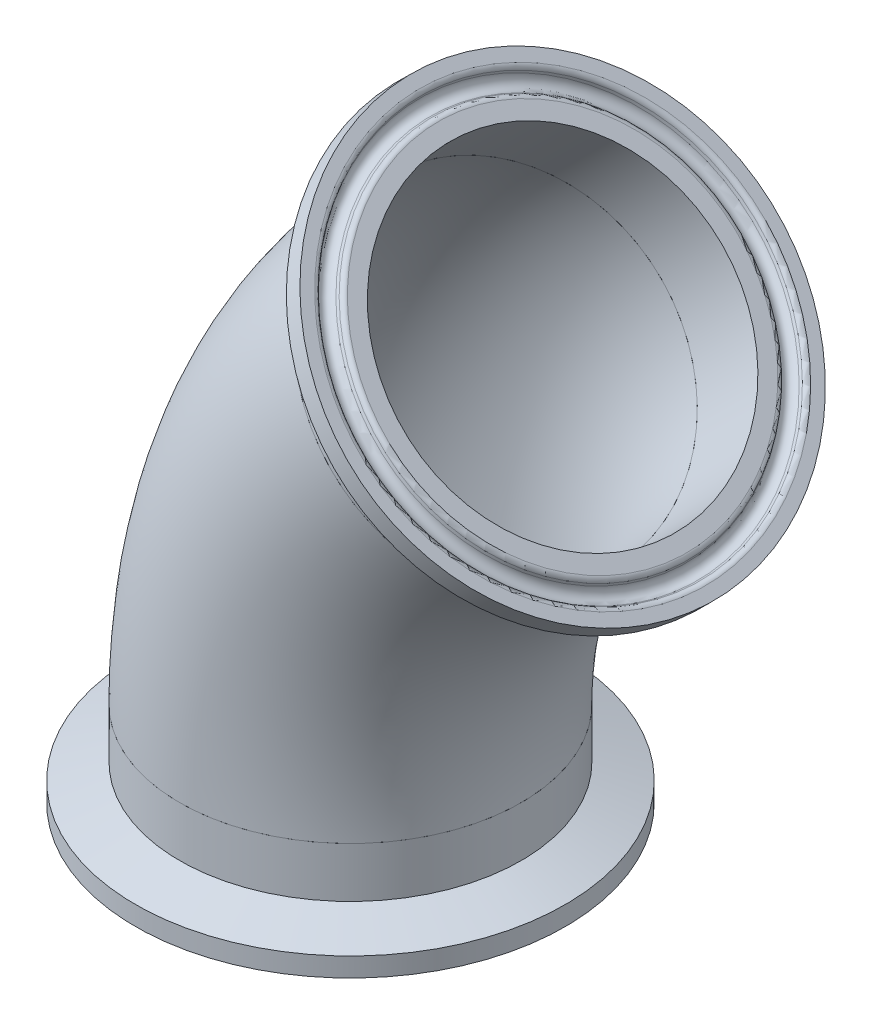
ISO-10303-21;
HEADER;
FILE_DESCRIPTION(('STEP AP214'),'2;1');
FILE_NAME('part.step','',(''),(''),'','','');
FILE_SCHEMA(('AUTOMOTIVE_DESIGN { 1 0 10303 214 1 1 1 1 }'));
ENDSEC;
DATA;
#1=APPLICATION_CONTEXT('core data for automotive mechanical design processes');
#2=APPLICATION_PROTOCOL_DEFINITION('international standard','automotive_design',2000,#1);
#3=PRODUCT_CONTEXT('',#1,'mechanical');
#4=PRODUCT('Part','Part','',(#3));
#5=PRODUCT_RELATED_PRODUCT_CATEGORY('part','',(#4));
#6=PRODUCT_DEFINITION_FORMATION('','',#4);
#7=PRODUCT_DEFINITION_CONTEXT('part definition',#1,'design');
#8=PRODUCT_DEFINITION('design','',#6,#7);
#9=PRODUCT_DEFINITION_SHAPE('','',#8);
#10=(LENGTH_UNIT() NAMED_UNIT(*) SI_UNIT(.MILLI.,.METRE.));
#11=(NAMED_UNIT(*) PLANE_ANGLE_UNIT() SI_UNIT($,.RADIAN.));
#12=(NAMED_UNIT(*) SI_UNIT($,.STERADIAN.) SOLID_ANGLE_UNIT());
#13=UNCERTAINTY_MEASURE_WITH_UNIT(LENGTH_MEASURE(1.E-05),#10,'distance_accuracy_value','');
#14=(GEOMETRIC_REPRESENTATION_CONTEXT(3) GLOBAL_UNCERTAINTY_ASSIGNED_CONTEXT((#13)) GLOBAL_UNIT_ASSIGNED_CONTEXT((#10,
#11,#12)) REPRESENTATION_CONTEXT('',''));
#15=CARTESIAN_POINT('',(0.,0.,0.));
#16=DIRECTION('',(0.,0.,1.));
#17=DIRECTION('',(1.,0.,0.));
#18=AXIS2_PLACEMENT_3D('',#15,#16,#17);
#19=CARTESIAN_POINT('',(49.8815076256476,67.8224797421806,41.6470972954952));
#20=DIRECTION('',(-0.710059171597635,-0.704142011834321,0.));
#21=DIRECTION('',(-0.703933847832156,0.709849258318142,-0.0243139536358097));
#22=AXIS2_PLACEMENT_3D('',#19,#20,#21);
#23=PLANE('',#22);
#24=CARTESIAN_POINT('',(49.8815076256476,67.8224797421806,41.6470972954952));
#25=DIRECTION('',(0.710059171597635,0.704142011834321,0.));
#26=DIRECTION('',(0.703933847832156,-0.709849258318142,0.0243139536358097));
#27=AXIS2_PLACEMENT_3D('',#24,#25,#26);
#28=CIRCLE('',#27,30.1591722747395);
#29=CARTESIAN_POINT('',(71.1115698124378,46.4140136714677,42.3803860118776));
#30=VERTEX_POINT('',#29);
#31=EDGE_CURVE('P0_E9',#30,#30,#28,.T.);
#32=ORIENTED_EDGE('',*,*,#31,.F.);
#33=EDGE_LOOP('',(#32));
#34=FACE_BOUND('',#33,.T.);
#35=CARTESIAN_POINT('',(49.8815076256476,67.8224797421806,41.6470972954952));
#36=DIRECTION('',(0.710059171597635,0.704142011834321,0.));
#37=DIRECTION('',(0.703933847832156,-0.709849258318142,0.0243139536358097));
#38=AXIS2_PLACEMENT_3D('',#35,#36,#37);
#39=CIRCLE('',#38,31.9532);
#40=CARTESIAN_POINT('',(72.374446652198,45.1405244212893,42.4240059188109));
#41=VERTEX_POINT('',#40);
#42=EDGE_CURVE('P0_E54',#41,#41,#39,.T.);
#43=ORIENTED_EDGE('',*,*,#42,.T.);
#44=EDGE_LOOP('',(#43));
#45=FACE_BOUND('',#44,.T.);
#46=ADVANCED_FACE('P0_F14',(#34,#45),#23,.F.);
#47=CARTESIAN_POINT('',(49.3224070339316,67.2680383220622,41.6470972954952));
#48=DIRECTION('',(0.710059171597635,0.704142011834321,0.));
#49=DIRECTION('',(0.703933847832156,-0.709849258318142,0.0243139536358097));
#50=AXIS2_PLACEMENT_3D('',#47,#48,#49);
#51=TOROIDAL_SURFACE('',#50,30.1591722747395,0.7874);
#52=CARTESIAN_POINT('',(49.5408650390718,67.4846758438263,41.6470972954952));
#53=DIRECTION('',(0.710059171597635,0.704142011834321,0.));
#54=DIRECTION('',(0.703933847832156,-0.709849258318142,0.0243139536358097));
#55=AXIS2_PLACEMENT_3D('',#52,#53,#54);
#56=CIRCLE('',#55,29.4343667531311);
#57=CARTESIAN_POINT('',(70.2607120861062,46.590712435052,42.3627631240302));
#58=VERTEX_POINT('',#57);
#59=EDGE_CURVE('P0_E20',#58,#58,#56,.T.);
#60=ORIENTED_EDGE('',*,*,#59,.F.);
#61=EDGE_LOOP('',(#60));
#62=FACE_BOUND('',#61,.T.);
#63=ORIENTED_EDGE('',*,*,#31,.T.);
#64=EDGE_LOOP('',(#63));
#65=FACE_BOUND('',#64,.T.);
#66=ADVANCED_FACE('P0_F96',(#62,#65),#51,.T.);
#67=CARTESIAN_POINT('',(49.2617290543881,67.2078659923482,41.6470972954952));
#68=DIRECTION('',(0.710059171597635,0.704142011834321,0.));
#69=DIRECTION('',(0.703933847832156,-0.709849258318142,0.0243139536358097));
#70=AXIS2_PLACEMENT_3D('',#67,#68,#69);
#71=CONICAL_SURFACE('',#70,29.2674986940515,0.401425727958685);
#72=ORIENTED_EDGE('',*,*,#59,.T.);
#73=EDGE_LOOP('',(#72));
#74=FACE_BOUND('',#73,.T.);
#75=CARTESIAN_POINT('',(49.2617290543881,67.2078659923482,41.6470972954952));
#76=DIRECTION('',(0.710059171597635,0.704142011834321,0.));
#77=DIRECTION('',(0.703933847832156,-0.709849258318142,0.0243139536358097));
#78=AXIS2_PLACEMENT_3D('',#75,#76,#77);
#79=CIRCLE('',#78,29.2674986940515);
#80=CARTESIAN_POINT('',(69.8641120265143,46.4323537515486,42.3587059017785));
#81=VERTEX_POINT('',#80);
#82=EDGE_CURVE('P0_E24',#81,#81,#79,.T.);
#83=ORIENTED_EDGE('',*,*,#82,.F.);
#84=EDGE_LOOP('',(#83));
#85=FACE_BOUND('',#84,.T.);
#86=ADVANCED_FACE('P0_F101',(#74,#85),#71,.F.);
#87=CARTESIAN_POINT('',(49.5929395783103,67.5363164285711,41.6470972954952));
#88=DIRECTION('',(0.710059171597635,0.704142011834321,0.));
#89=DIRECTION('',(0.703933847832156,-0.709849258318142,0.0243139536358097));
#90=AXIS2_PLACEMENT_3D('',#87,#88,#89);
#91=TOROIDAL_SURFACE('',#90,28.1686,1.1938);
#92=CARTESIAN_POINT('',(49.261729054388,67.2078659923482,41.6470972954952));
#93=DIRECTION('',(0.710059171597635,0.704142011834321,0.));
#94=DIRECTION('',(0.703933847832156,-0.709849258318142,0.0243139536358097));
#95=AXIS2_PLACEMENT_3D('',#92,#93,#94);
#96=CIRCLE('',#95,27.0697013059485);
#97=CARTESIAN_POINT('',(68.3170080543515,47.992458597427,42.3052687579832));
#98=VERTEX_POINT('',#97);
#99=EDGE_CURVE('P0_E28',#98,#98,#96,.T.);
#100=ORIENTED_EDGE('',*,*,#99,.F.);
#101=EDGE_LOOP('',(#100));
#102=FACE_BOUND('',#101,.T.);
#103=ORIENTED_EDGE('',*,*,#82,.T.);
#104=EDGE_LOOP('',(#103));
#105=FACE_BOUND('',#104,.T.);
#106=ADVANCED_FACE('P0_F106',(#102,#105),#91,.F.);
#107=CARTESIAN_POINT('',(49.261729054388,67.2078659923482,41.6470972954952));
#108=DIRECTION('',(-0.710059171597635,-0.704142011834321,0.));
#109=DIRECTION('',(-0.703933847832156,0.709849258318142,-0.0243139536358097));
#110=AXIS2_PLACEMENT_3D('',#107,#108,#109);
#111=CONICAL_SURFACE('',#110,27.0697013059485,0.401425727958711);
#112=CARTESIAN_POINT('',(49.5408650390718,67.4846758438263,41.6470972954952));
#113=DIRECTION('',(0.710059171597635,0.704142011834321,0.));
#114=DIRECTION('',(0.703933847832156,-0.709849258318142,0.0243139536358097));
#115=AXIS2_PLACEMENT_3D('',#112,#113,#114);
#116=CIRCLE('',#115,26.9028332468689);
#117=CARTESIAN_POINT('',(68.4786799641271,48.3877196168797,42.3012115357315));
#118=VERTEX_POINT('',#117);
#119=EDGE_CURVE('P0_E33',#118,#118,#116,.T.);
#120=ORIENTED_EDGE('',*,*,#119,.F.);
#121=EDGE_LOOP('',(#120));
#122=FACE_BOUND('',#121,.T.);
#123=ORIENTED_EDGE('',*,*,#99,.T.);
#124=EDGE_LOOP('',(#123));
#125=FACE_BOUND('',#124,.T.);
#126=ADVANCED_FACE('P0_F111',(#122,#125),#111,.T.);
#127=CARTESIAN_POINT('',(49.3224070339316,67.2680383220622,41.6470972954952));
#128=DIRECTION('',(0.710059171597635,0.704142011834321,0.));
#129=DIRECTION('',(0.703933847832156,-0.709849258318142,0.0243139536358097));
#130=AXIS2_PLACEMENT_3D('',#127,#128,#129);
#131=TOROIDAL_SURFACE('',#130,26.1780277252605,0.787399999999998);
#132=ORIENTED_EDGE('',*,*,#119,.T.);
#133=EDGE_LOOP('',(#132));
#134=FACE_BOUND('',#133,.T.);
#135=CARTESIAN_POINT('',(49.8815076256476,67.8224797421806,41.6470972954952));
#136=DIRECTION('',(0.710059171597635,0.704142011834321,0.));
#137=DIRECTION('',(0.703933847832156,-0.709849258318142,0.0243139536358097));
#138=AXIS2_PLACEMENT_3D('',#135,#136,#137);
#139=CIRCLE('',#138,26.1780277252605);
#140=CARTESIAN_POINT('',(68.3091074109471,49.2400261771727,42.2835886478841));
#141=VERTEX_POINT('',#140);
#142=EDGE_CURVE('P0_E36',#141,#141,#139,.T.);
#143=ORIENTED_EDGE('',*,*,#142,.F.);
#144=EDGE_LOOP('',(#143));
#145=FACE_BOUND('',#144,.T.);
#146=ADVANCED_FACE('P0_F92',(#134,#145),#131,.T.);
#147=CARTESIAN_POINT('',(49.8815076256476,67.8224797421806,41.6470972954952));
#148=DIRECTION('',(-0.710059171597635,-0.704142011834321,0.));
#149=DIRECTION('',(-0.703933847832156,0.709849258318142,-0.0243139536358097));
#150=AXIS2_PLACEMENT_3D('',#147,#148,#149);
#151=PLANE('',#150);
#152=CARTESIAN_POINT('',(49.8815076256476,67.8224797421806,41.6470972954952));
#153=DIRECTION('',(0.710059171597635,0.704142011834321,0.));
#154=DIRECTION('',(0.703933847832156,-0.709849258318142,0.0243139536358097));
#155=AXIS2_PLACEMENT_3D('',#152,#153,#154);
#156=CIRCLE('',#155,23.749);
#157=CARTESIAN_POINT('',(66.5992325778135,50.964269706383,42.224529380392));
#158=VERTEX_POINT('',#157);
#159=EDGE_CURVE('P0_E39',#158,#158,#156,.T.);
#160=ORIENTED_EDGE('',*,*,#159,.F.);
#161=EDGE_LOOP('',(#160));
#162=FACE_BOUND('',#161,.T.);
#163=ORIENTED_EDGE('',*,*,#142,.T.);
#164=EDGE_LOOP('',(#163));
#165=FACE_BOUND('',#164,.T.);
#166=ADVANCED_FACE('P0_F85',(#162,#165),#151,.F.);
#167=CARTESIAN_POINT('',(49.8815076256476,67.8224797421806,41.6470972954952));
#168=DIRECTION('',(0.710059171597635,0.704142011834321,0.));
#169=DIRECTION('',(0.703933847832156,-0.709849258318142,0.0243139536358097));
#170=AXIS2_PLACEMENT_3D('',#167,#168,#169);
#171=CYLINDRICAL_SURFACE('',#170,23.749);
#172=ORIENTED_EDGE('',*,*,#159,.T.);
#173=EDGE_LOOP('',(#172));
#174=FACE_BOUND('',#173,.T.);
#175=CARTESIAN_POINT('',(40.8637561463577,58.8798761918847,41.6470972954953));
#176=DIRECTION('',(0.710059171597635,0.704142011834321,0.));
#177=DIRECTION('',(0.703933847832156,-0.709849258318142,0.0243139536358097));
#178=AXIS2_PLACEMENT_3D('',#175,#176,#177);
#179=CIRCLE('',#178,23.749);
#180=CARTESIAN_POINT('',(57.5814810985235,42.0216661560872,42.2245293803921));
#181=VERTEX_POINT('',#180);
#182=EDGE_CURVE('P0_E42',#181,#181,#179,.T.);
#183=ORIENTED_EDGE('',*,*,#182,.F.);
#184=EDGE_LOOP('',(#183));
#185=FACE_BOUND('',#184,.T.);
#186=ADVANCED_FACE('P0_F80',(#174,#185),#171,.F.);
#187=CARTESIAN_POINT('',(40.8637561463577,58.8798761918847,41.6470972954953));
#188=DIRECTION('',(0.710059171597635,0.704142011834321,0.));
#189=DIRECTION('',(0.703933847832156,-0.709849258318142,0.0243139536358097));
#190=AXIS2_PLACEMENT_3D('',#187,#188,#189);
#191=PLANE('',#190);
#192=CARTESIAN_POINT('',(40.8637561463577,58.8798761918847,41.6470972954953));
#193=DIRECTION('',(0.710059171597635,0.704142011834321,0.));
#194=DIRECTION('',(0.703933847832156,-0.709849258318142,0.0243139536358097));
#195=AXIS2_PLACEMENT_3D('',#192,#193,#194);
#196=CIRCLE('',#195,25.4);
#197=CARTESIAN_POINT('',(58.7436758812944,40.8497050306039,42.2646717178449));
#198=VERTEX_POINT('',#197);
#199=EDGE_CURVE('P0_E45',#198,#198,#196,.T.);
#200=ORIENTED_EDGE('',*,*,#199,.F.);
#201=EDGE_LOOP('',(#200));
#202=FACE_BOUND('',#201,.T.);
#203=ORIENTED_EDGE('',*,*,#182,.T.);
#204=EDGE_LOOP('',(#203));
#205=FACE_BOUND('',#204,.T.);
#206=ADVANCED_FACE('P0_F74',(#202,#205),#191,.F.);
#207=CARTESIAN_POINT('',(49.8815076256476,67.8224797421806,41.6470972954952));
#208=DIRECTION('',(0.710059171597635,0.704142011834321,0.));
#209=DIRECTION('',(0.703933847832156,-0.709849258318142,0.0243139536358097));
#210=AXIS2_PLACEMENT_3D('',#207,#208,#209);
#211=CYLINDRICAL_SURFACE('',#210,25.4);
#212=CARTESIAN_POINT('',(46.1679196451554,64.1398383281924,41.6470972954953));
#213=DIRECTION('',(0.710059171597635,0.704142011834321,0.));
#214=DIRECTION('',(0.703933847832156,-0.709849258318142,0.0243139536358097));
#215=AXIS2_PLACEMENT_3D('',#212,#213,#214);
#216=CIRCLE('',#215,25.4);
#217=CARTESIAN_POINT('',(64.0478393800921,46.1096671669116,42.2646717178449));
#218=VERTEX_POINT('',#217);
#219=EDGE_CURVE('P0_E48',#218,#218,#216,.T.);
#220=ORIENTED_EDGE('',*,*,#219,.F.);
#221=EDGE_LOOP('',(#220));
#222=FACE_BOUND('',#221,.T.);
#223=ORIENTED_EDGE('',*,*,#199,.T.);
#224=EDGE_LOOP('',(#223));
#225=FACE_BOUND('',#224,.T.);
#226=ADVANCED_FACE('P0_F68',(#222,#225),#211,.T.);
#227=CARTESIAN_POINT('',(46.1679196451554,64.1398383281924,41.6470972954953));
#228=DIRECTION('',(0.710059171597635,0.704142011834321,0.));
#229=DIRECTION('',(0.703933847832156,-0.709849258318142,0.0243139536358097));
#230=AXIS2_PLACEMENT_3D('',#227,#228,#229);
#231=CONICAL_SURFACE('',#230,25.4,1.22173047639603);
#232=CARTESIAN_POINT('',(47.8615312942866,65.8193365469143,41.6470972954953));
#233=DIRECTION('',(0.710059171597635,0.704142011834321,0.));
#234=DIRECTION('',(0.703933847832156,-0.709849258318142,0.0243139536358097));
#235=AXIS2_PLACEMENT_3D('',#232,#233,#234);
#236=CIRCLE('',#235,31.9532);
#237=CARTESIAN_POINT('',(70.3544703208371,43.137381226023,42.4240059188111));
#238=VERTEX_POINT('',#237);
#239=EDGE_CURVE('P0_E51',#238,#238,#236,.T.);
#240=ORIENTED_EDGE('',*,*,#239,.F.);
#241=EDGE_LOOP('',(#240));
#242=FACE_BOUND('',#241,.T.);
#243=ORIENTED_EDGE('',*,*,#219,.T.);
#244=EDGE_LOOP('',(#243));
#245=FACE_BOUND('',#244,.T.);
#246=ADVANCED_FACE('P0_F62',(#242,#245),#231,.T.);
#247=CARTESIAN_POINT('',(49.8815076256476,67.8224797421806,41.6470972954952));
#248=DIRECTION('',(0.710059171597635,0.704142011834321,0.));
#249=DIRECTION('',(0.703933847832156,-0.709849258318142,0.0243139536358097));
#250=AXIS2_PLACEMENT_3D('',#247,#248,#249);
#251=CYLINDRICAL_SURFACE('',#250,31.9532);
#252=ORIENTED_EDGE('',*,*,#42,.F.);
#253=EDGE_LOOP('',(#252));
#254=FACE_BOUND('',#253,.T.);
#255=ORIENTED_EDGE('',*,*,#239,.T.);
#256=EDGE_LOOP('',(#255));
#257=FACE_BOUND('',#256,.T.);
#258=ADVANCED_FACE('P0_F59',(#254,#257),#251,.T.);
#259=CLOSED_SHELL('',(#46,#66,#86,#106,#126,#146,#166,#186,#206,#226,#246,#258));
#260=MANIFOLD_SOLID_BREP('P0_B1',#259);
#261=CARTESIAN_POINT('',(18.3193774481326,-7.9266326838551,41.6470972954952));
#262=DIRECTION('',(0.,1.,0.));
#263=DIRECTION('',(0.,0.,1.));
#264=AXIS2_PLACEMENT_3D('',#261,#262,#263);
#265=PLANE('',#264);
#266=CARTESIAN_POINT('',(18.3193774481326,-7.9266326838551,41.6470972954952));
#267=DIRECTION('',(0.,-1.,0.));
#268=DIRECTION('',(0.,0.,-1.));
#269=AXIS2_PLACEMENT_3D('',#266,#267,#268);
#270=CIRCLE('',#269,30.1591722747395);
#271=CARTESIAN_POINT('',(18.3193774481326,-7.92663268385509,11.4879250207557));
#272=VERTEX_POINT('',#271);
#273=EDGE_CURVE('P1_E10',#272,#272,#270,.T.);
#274=ORIENTED_EDGE('',*,*,#273,.F.);
#275=EDGE_LOOP('',(#274));
#276=FACE_BOUND('',#275,.T.);
#277=CARTESIAN_POINT('',(18.3193774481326,-7.9266326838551,41.6470972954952));
#278=DIRECTION('',(0.,-1.,0.));
#279=DIRECTION('',(0.,0.,-1.));
#280=AXIS2_PLACEMENT_3D('',#277,#278,#279);
#281=CIRCLE('',#280,31.9532);
#282=CARTESIAN_POINT('',(18.3193774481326,-7.92663268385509,9.69389729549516));
#283=VERTEX_POINT('',#282);
#284=EDGE_CURVE('P1_E55',#283,#283,#281,.T.);
#285=ORIENTED_EDGE('',*,*,#284,.T.);
#286=EDGE_LOOP('',(#285));
#287=FACE_BOUND('',#286,.T.);
#288=ADVANCED_FACE('P1_F15',(#276,#287),#265,.F.);
#289=CARTESIAN_POINT('',(18.3193774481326,-7.13923268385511,41.6470972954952));
#290=DIRECTION('',(0.,-1.,0.));
#291=DIRECTION('',(0.,0.,-1.));
#292=AXIS2_PLACEMENT_3D('',#289,#290,#291);
#293=TOROIDAL_SURFACE('',#292,30.1591722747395,0.7874);
#294=CARTESIAN_POINT('',(18.3193774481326,-7.44689437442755,41.6470972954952));
#295=DIRECTION('',(0.,-1.,0.));
#296=DIRECTION('',(0.,0.,-1.));
#297=AXIS2_PLACEMENT_3D('',#294,#295,#296);
#298=CIRCLE('',#297,29.4343667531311);
#299=CARTESIAN_POINT('',(18.3193774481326,-7.44689437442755,12.2127305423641));
#300=VERTEX_POINT('',#299);
#301=EDGE_CURVE('P1_E21',#300,#300,#298,.T.);
#302=ORIENTED_EDGE('',*,*,#301,.F.);
#303=EDGE_LOOP('',(#302));
#304=FACE_BOUND('',#303,.T.);
#305=ORIENTED_EDGE('',*,*,#273,.T.);
#306=EDGE_LOOP('',(#305));
#307=FACE_BOUND('',#306,.T.);
#308=ADVANCED_FACE('P1_F97',(#304,#307),#293,.T.);
#309=CARTESIAN_POINT('',(18.3193774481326,-7.05377786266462,41.6470972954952));
#310=DIRECTION('',(0.,-1.,0.));
#311=DIRECTION('',(0.,0.,-1.));
#312=AXIS2_PLACEMENT_3D('',#309,#310,#311);
#313=CONICAL_SURFACE('',#312,29.2674986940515,0.401425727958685);
#314=ORIENTED_EDGE('',*,*,#301,.T.);
#315=EDGE_LOOP('',(#314));
#316=FACE_BOUND('',#315,.T.);
#317=CARTESIAN_POINT('',(18.3193774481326,-7.05377786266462,41.6470972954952));
#318=DIRECTION('',(0.,-1.,0.));
#319=DIRECTION('',(0.,0.,-1.));
#320=AXIS2_PLACEMENT_3D('',#317,#318,#319);
#321=CIRCLE('',#320,29.2674986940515);
#322=CARTESIAN_POINT('',(18.3193774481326,-7.05377786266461,12.3795986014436));
#323=VERTEX_POINT('',#322);
#324=EDGE_CURVE('P1_E25',#323,#323,#321,.T.);
#325=ORIENTED_EDGE('',*,*,#324,.F.);
#326=EDGE_LOOP('',(#325));
#327=FACE_BOUND('',#326,.T.);
#328=ADVANCED_FACE('P1_F102',(#316,#327),#313,.F.);
#329=CARTESIAN_POINT('',(18.3193774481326,-7.52023268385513,41.6470972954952));
#330=DIRECTION('',(0.,-1.,0.));
#331=DIRECTION('',(0.,0.,-1.));
#332=AXIS2_PLACEMENT_3D('',#329,#330,#331);
#333=TOROIDAL_SURFACE('',#332,28.1686,1.1938);
#334=CARTESIAN_POINT('',(18.3193774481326,-7.05377786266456,41.6470972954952));
#335=DIRECTION('',(0.,-1.,0.));
#336=DIRECTION('',(0.,0.,-1.));
#337=AXIS2_PLACEMENT_3D('',#334,#335,#336);
#338=CIRCLE('',#337,27.0697013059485);
#339=CARTESIAN_POINT('',(18.3193774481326,-7.05377786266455,14.5773959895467));
#340=VERTEX_POINT('',#339);
#341=EDGE_CURVE('P1_E29',#340,#340,#338,.T.);
#342=ORIENTED_EDGE('',*,*,#341,.F.);
#343=EDGE_LOOP('',(#342));
#344=FACE_BOUND('',#343,.T.);
#345=ORIENTED_EDGE('',*,*,#324,.T.);
#346=EDGE_LOOP('',(#345));
#347=FACE_BOUND('',#346,.T.);
#348=ADVANCED_FACE('P1_F107',(#344,#347),#333,.F.);
#349=CARTESIAN_POINT('',(18.3193774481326,-7.05377786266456,41.6470972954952));
#350=DIRECTION('',(0.,1.,0.));
#351=DIRECTION('',(0.,0.,1.));
#352=AXIS2_PLACEMENT_3D('',#349,#350,#351);
#353=CONICAL_SURFACE('',#352,27.0697013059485,0.401425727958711);
#354=CARTESIAN_POINT('',(18.3193774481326,-7.44689437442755,41.6470972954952));
#355=DIRECTION('',(0.,-1.,0.));
#356=DIRECTION('',(0.,0.,-1.));
#357=AXIS2_PLACEMENT_3D('',#354,#355,#356);
#358=CIRCLE('',#357,26.9028332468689);
#359=CARTESIAN_POINT('',(18.3193774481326,-7.44689437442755,14.7442640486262));
#360=VERTEX_POINT('',#359);
#361=EDGE_CURVE('P1_E34',#360,#360,#358,.T.);
#362=ORIENTED_EDGE('',*,*,#361,.F.);
#363=EDGE_LOOP('',(#362));
#364=FACE_BOUND('',#363,.T.);
#365=ORIENTED_EDGE('',*,*,#341,.T.);
#366=EDGE_LOOP('',(#365));
#367=FACE_BOUND('',#366,.T.);
#368=ADVANCED_FACE('P1_F112',(#364,#367),#353,.T.);
#369=CARTESIAN_POINT('',(18.3193774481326,-7.13923268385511,41.6470972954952));
#370=DIRECTION('',(0.,-1.,0.));
#371=DIRECTION('',(0.,0.,-1.));
#372=AXIS2_PLACEMENT_3D('',#369,#370,#371);
#373=TOROIDAL_SURFACE('',#372,26.1780277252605,0.787399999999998);
#374=ORIENTED_EDGE('',*,*,#361,.T.);
#375=EDGE_LOOP('',(#374));
#376=FACE_BOUND('',#375,.T.);
#377=CARTESIAN_POINT('',(18.3193774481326,-7.9266326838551,41.6470972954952));
#378=DIRECTION('',(0.,-1.,0.));
#379=DIRECTION('',(0.,0.,-1.));
#380=AXIS2_PLACEMENT_3D('',#377,#378,#379);
#381=CIRCLE('',#380,26.1780277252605);
#382=CARTESIAN_POINT('',(18.3193774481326,-7.92663268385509,15.4690695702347));
#383=VERTEX_POINT('',#382);
#384=EDGE_CURVE('P1_E37',#383,#383,#381,.T.);
#385=ORIENTED_EDGE('',*,*,#384,.F.);
#386=EDGE_LOOP('',(#385));
#387=FACE_BOUND('',#386,.T.);
#388=ADVANCED_FACE('P1_F93',(#376,#387),#373,.T.);
#389=CARTESIAN_POINT('',(18.3193774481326,-7.9266326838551,41.6470972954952));
#390=DIRECTION('',(0.,1.,0.));
#391=DIRECTION('',(0.,0.,1.));
#392=AXIS2_PLACEMENT_3D('',#389,#390,#391);
#393=PLANE('',#392);
#394=CARTESIAN_POINT('',(18.3193774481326,-7.9266326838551,41.6470972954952));
#395=DIRECTION('',(0.,-1.,0.));
#396=DIRECTION('',(0.,0.,-1.));
#397=AXIS2_PLACEMENT_3D('',#394,#395,#396);
#398=CIRCLE('',#397,23.749);
#399=CARTESIAN_POINT('',(18.3193774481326,-7.92663268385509,17.8980972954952));
#400=VERTEX_POINT('',#399);
#401=EDGE_CURVE('P1_E40',#400,#400,#398,.T.);
#402=ORIENTED_EDGE('',*,*,#401,.F.);
#403=EDGE_LOOP('',(#402));
#404=FACE_BOUND('',#403,.T.);
#405=ORIENTED_EDGE('',*,*,#384,.T.);
#406=EDGE_LOOP('',(#405));
#407=FACE_BOUND('',#406,.T.);
#408=ADVANCED_FACE('P1_F86',(#404,#407),#393,.F.);
#409=CARTESIAN_POINT('',(18.3193774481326,-7.9266326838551,41.6470972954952));
#410=DIRECTION('',(0.,-1.,0.));
#411=DIRECTION('',(0.,0.,-1.));
#412=AXIS2_PLACEMENT_3D('',#409,#410,#411);
#413=CYLINDRICAL_SURFACE('',#412,23.749);
#414=ORIENTED_EDGE('',*,*,#401,.T.);
#415=EDGE_LOOP('',(#414));
#416=FACE_BOUND('',#415,.T.);
#417=CARTESIAN_POINT('',(18.3193774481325,4.77336731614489,41.6470972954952));
#418=DIRECTION('',(0.,-1.,0.));
#419=DIRECTION('',(0.,0.,-1.));
#420=AXIS2_PLACEMENT_3D('',#417,#418,#419);
#421=CIRCLE('',#420,23.749);
#422=CARTESIAN_POINT('',(18.3193774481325,4.7733673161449,17.8980972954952));
#423=VERTEX_POINT('',#422);
#424=EDGE_CURVE('P1_E43',#423,#423,#421,.T.);
#425=ORIENTED_EDGE('',*,*,#424,.F.);
#426=EDGE_LOOP('',(#425));
#427=FACE_BOUND('',#426,.T.);
#428=ADVANCED_FACE('P1_F81',(#416,#427),#413,.F.);
#429=CARTESIAN_POINT('',(18.3193774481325,4.77336731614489,41.6470972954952));
#430=DIRECTION('',(0.,-1.,0.));
#431=DIRECTION('',(0.,0.,-1.));
#432=AXIS2_PLACEMENT_3D('',#429,#430,#431);
#433=PLANE('',#432);
#434=CARTESIAN_POINT('',(18.3193774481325,4.77336731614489,41.6470972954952));
#435=DIRECTION('',(0.,-1.,0.));
#436=DIRECTION('',(0.,0.,-1.));
#437=AXIS2_PLACEMENT_3D('',#434,#435,#436);
#438=CIRCLE('',#437,25.4);
#439=CARTESIAN_POINT('',(18.3193774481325,4.7733673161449,16.2470972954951));
#440=VERTEX_POINT('',#439);
#441=EDGE_CURVE('P1_E46',#440,#440,#438,.T.);
#442=ORIENTED_EDGE('',*,*,#441,.F.);
#443=EDGE_LOOP('',(#442));
#444=FACE_BOUND('',#443,.T.);
#445=ORIENTED_EDGE('',*,*,#424,.T.);
#446=EDGE_LOOP('',(#445));
#447=FACE_BOUND('',#446,.T.);
#448=ADVANCED_FACE('P1_F75',(#444,#447),#433,.F.);
#449=CARTESIAN_POINT('',(18.3193774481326,-7.9266326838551,41.6470972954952));
#450=DIRECTION('',(0.,-1.,0.));
#451=DIRECTION('',(0.,0.,-1.));
#452=AXIS2_PLACEMENT_3D('',#449,#450,#451);
#453=CYLINDRICAL_SURFACE('',#452,25.4);
#454=CARTESIAN_POINT('',(18.3193774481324,-2.69666294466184,41.6470972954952));
#455=DIRECTION('',(0.,-1.,0.));
#456=DIRECTION('',(0.,0.,-1.));
#457=AXIS2_PLACEMENT_3D('',#454,#455,#456);
#458=CIRCLE('',#457,25.4);
#459=CARTESIAN_POINT('',(18.3193774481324,-2.69666294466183,16.2470972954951));
#460=VERTEX_POINT('',#459);
#461=EDGE_CURVE('P1_E49',#460,#460,#458,.T.);
#462=ORIENTED_EDGE('',*,*,#461,.F.);
#463=EDGE_LOOP('',(#462));
#464=FACE_BOUND('',#463,.T.);
#465=ORIENTED_EDGE('',*,*,#441,.T.);
#466=EDGE_LOOP('',(#465));
#467=FACE_BOUND('',#466,.T.);
#468=ADVANCED_FACE('P1_F69',(#464,#467),#453,.T.);
#469=CARTESIAN_POINT('',(18.3193774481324,-2.69666294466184,41.6470972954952));
#470=DIRECTION('',(0.,-1.,0.));
#471=DIRECTION('',(0.,0.,-1.));
#472=AXIS2_PLACEMENT_3D('',#469,#470,#471);
#473=CONICAL_SURFACE('',#472,25.4,1.22173047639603);
#474=CARTESIAN_POINT('',(18.3193774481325,-5.08183268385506,41.6470972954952));
#475=DIRECTION('',(0.,-1.,0.));
#476=DIRECTION('',(0.,0.,-1.));
#477=AXIS2_PLACEMENT_3D('',#474,#475,#476);
#478=CIRCLE('',#477,31.9532);
#479=CARTESIAN_POINT('',(18.3193774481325,-5.08183268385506,9.69389729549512));
#480=VERTEX_POINT('',#479);
#481=EDGE_CURVE('P1_E52',#480,#480,#478,.T.);
#482=ORIENTED_EDGE('',*,*,#481,.F.);
#483=EDGE_LOOP('',(#482));
#484=FACE_BOUND('',#483,.T.);
#485=ORIENTED_EDGE('',*,*,#461,.T.);
#486=EDGE_LOOP('',(#485));
#487=FACE_BOUND('',#486,.T.);
#488=ADVANCED_FACE('P1_F63',(#484,#487),#473,.T.);
#489=CARTESIAN_POINT('',(18.3193774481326,-7.9266326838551,41.6470972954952));
#490=DIRECTION('',(0.,-1.,0.));
#491=DIRECTION('',(0.,0.,-1.));
#492=AXIS2_PLACEMENT_3D('',#489,#490,#491);
#493=CYLINDRICAL_SURFACE('',#492,31.9532);
#494=ORIENTED_EDGE('',*,*,#284,.F.);
#495=EDGE_LOOP('',(#494));
#496=FACE_BOUND('',#495,.T.);
#497=ORIENTED_EDGE('',*,*,#481,.T.);
#498=EDGE_LOOP('',(#497));
#499=FACE_BOUND('',#498,.T.);
#500=ADVANCED_FACE('P1_F60',(#496,#499),#493,.T.);
#501=CLOSED_SHELL('',(#288,#308,#328,#348,#368,#388,#408,#428,#448,#468,#488,#500));
#502=MANIFOLD_SOLID_BREP('P1_B1',#501);
#503=CARTESIAN_POINT('',(94.5193774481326,4.7733673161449,41.6470972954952));
#504=DIRECTION('',(0.,0.,1.));
#505=DIRECTION('',(1.,0.,0.));
#506=AXIS2_PLACEMENT_3D('',#503,#504,#505);
#507=TOROIDAL_SURFACE('',#506,76.2,25.4);
#508=CARTESIAN_POINT('',(40.8637561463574,58.8798761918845,41.6470972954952));
#509=DIRECTION('',(0.710059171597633,0.70414201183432,0.));
#510=DIRECTION('',(0.,0.,1.));
#511=AXIS2_PLACEMENT_3D('',#508,#509,#510);
#512=CIRCLE('',#511,25.4);
#513=CARTESIAN_POINT('',(22.9785490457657,76.9153791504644,41.6470972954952));
#514=VERTEX_POINT('',#513);
#515=EDGE_CURVE('P2_E10',#514,#514,#512,.T.);
#516=CARTESIAN_POINT('',(18.3193774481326,4.7733673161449,41.6470972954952));
#517=DIRECTION('',(0.,1.,0.));
#518=DIRECTION('',(0.,0.,1.));
#519=AXIS2_PLACEMENT_3D('',#516,#517,#518);
#520=CIRCLE('',#519,25.4);
#521=CARTESIAN_POINT('',(-7.08062255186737,4.7733673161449,41.6470972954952));
#522=VERTEX_POINT('',#521);
#523=EDGE_CURVE('P2_E21',#522,#522,#520,.T.);
#524=CARTESIAN_POINT('',(94.5193774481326,4.7733673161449,41.6470972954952));
#525=DIRECTION('',(0.,0.,1.));
#526=DIRECTION('',(1.,0.,0.));
#527=AXIS2_PLACEMENT_3D('',#524,#525,#526);
#528=CIRCLE('',#527,101.6);
#529=EDGE_CURVE('',#514,#522,#528,.T.);
#530=ORIENTED_EDGE('',*,*,#515,.F.);
#531=ORIENTED_EDGE('',*,*,#523,.T.);
#532=ORIENTED_EDGE('',*,*,#529,.T.);
#533=ORIENTED_EDGE('',*,*,#529,.F.);
#534=EDGE_LOOP('',(#530,#532,#531,#533));
#535=FACE_BOUND('',#534,.T.);
#536=ADVANCED_FACE('P2_F15',(#535),#507,.T.);
#537=CARTESIAN_POINT('',(40.8637561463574,58.8798761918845,41.6470972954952));
#538=DIRECTION('',(0.710059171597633,0.70414201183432,0.));
#539=DIRECTION('',(0.,0.,1.));
#540=AXIS2_PLACEMENT_3D('',#537,#538,#539);
#541=PLANE('',#540);
#542=CARTESIAN_POINT('',(40.8637561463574,58.8798761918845,41.6470972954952));
#543=DIRECTION('',(0.710059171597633,0.70414201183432,0.));
#544=DIRECTION('',(-0.70414201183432,0.710059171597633,0.));
#545=AXIS2_PLACEMENT_3D('',#542,#543,#544);
#546=CIRCLE('',#545,23.749);
#547=CARTESIAN_POINT('',(24.1410875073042,75.7430714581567,41.6470972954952));
#548=VERTEX_POINT('',#547);
#549=EDGE_CURVE('P2_E25',#548,#548,#546,.T.);
#550=ORIENTED_EDGE('',*,*,#549,.F.);
#551=EDGE_LOOP('',(#550));
#552=FACE_BOUND('',#551,.T.);
#553=ORIENTED_EDGE('',*,*,#515,.T.);
#554=EDGE_LOOP('',(#553));
#555=FACE_BOUND('',#554,.T.);
#556=ADVANCED_FACE('P2_F46',(#552,#555),#541,.T.);
#557=CARTESIAN_POINT('',(18.3193774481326,4.7733673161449,41.6470972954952));
#558=DIRECTION('',(0.,1.,0.));
#559=DIRECTION('',(0.,0.,1.));
#560=AXIS2_PLACEMENT_3D('',#557,#558,#559);
#561=PLANE('',#560);
#562=CARTESIAN_POINT('',(18.3193774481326,4.7733673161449,41.6470972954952));
#563=DIRECTION('',(0.,1.,0.));
#564=DIRECTION('',(0.,0.,1.));
#565=AXIS2_PLACEMENT_3D('',#562,#563,#564);
#566=CIRCLE('',#565,23.749);
#567=CARTESIAN_POINT('',(-5.42962255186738,4.7733673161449,41.6470972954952));
#568=VERTEX_POINT('',#567);
#569=EDGE_CURVE('P2_E29',#568,#568,#566,.T.);
#570=ORIENTED_EDGE('',*,*,#569,.T.);
#571=EDGE_LOOP('',(#570));
#572=FACE_BOUND('',#571,.T.);
#573=ORIENTED_EDGE('',*,*,#523,.F.);
#574=EDGE_LOOP('',(#573));
#575=FACE_BOUND('',#574,.T.);
#576=ADVANCED_FACE('P2_F35',(#572,#575),#561,.F.);
#577=CARTESIAN_POINT('',(94.5193774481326,4.7733673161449,41.6470972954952));
#578=DIRECTION('',(0.,0.,1.));
#579=DIRECTION('',(1.,0.,0.));
#580=AXIS2_PLACEMENT_3D('',#577,#578,#579);
#581=TOROIDAL_SURFACE('',#580,76.2,23.749);
#582=CARTESIAN_POINT('',(94.5193774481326,4.7733673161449,41.6470972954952));
#583=DIRECTION('',(0.,0.,1.));
#584=DIRECTION('',(1.,0.,0.));
#585=AXIS2_PLACEMENT_3D('',#582,#583,#584);
#586=CIRCLE('',#585,99.949);
#587=EDGE_CURVE('',#548,#568,#586,.T.);
#588=ORIENTED_EDGE('',*,*,#549,.T.);
#589=ORIENTED_EDGE('',*,*,#569,.F.);
#590=ORIENTED_EDGE('',*,*,#587,.T.);
#591=ORIENTED_EDGE('',*,*,#587,.F.);
#592=EDGE_LOOP('',(#588,#590,#589,#591));
#593=FACE_BOUND('',#592,.T.);
#594=ADVANCED_FACE('P2_F38',(#593),#581,.F.);
#595=CLOSED_SHELL('',(#536,#556,#576,#594));
#596=MANIFOLD_SOLID_BREP('P2_B1',#595);
#597=ADVANCED_BREP_SHAPE_REPRESENTATION('',(#18,#260,#502,#596),#14);
#598=SHAPE_DEFINITION_REPRESENTATION(#9,#597);
ENDSEC;
END-ISO-10303-21;
